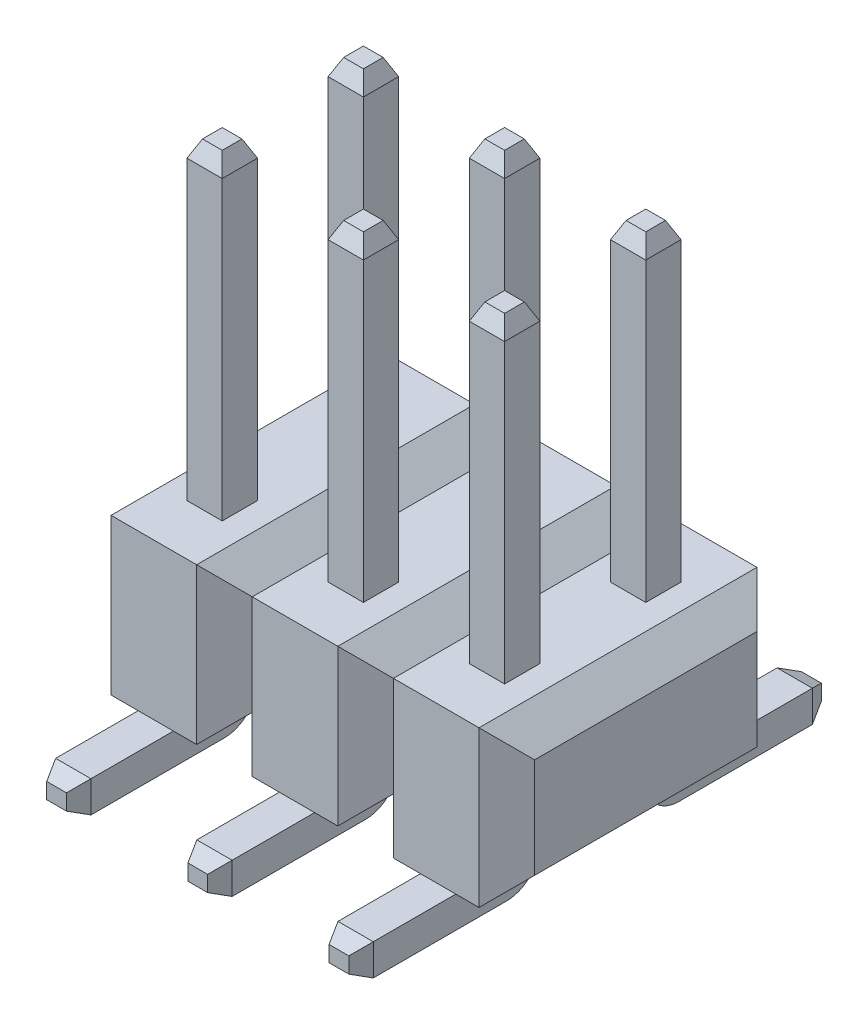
from build123d import *
from OCP.BRepFilletAPI import BRepFilletAPI_MakeChamfer

# Parameters (mm, degrees)
SKETCH1_W                = 2.54
SKETCH1_H                = 5
BOSS_EXTRUDE1_DEPTH      = 2.8
CHAMFER1_SIZE            = 0.5
LPATTERN1_COUNT          = 3
LPATTERN1_PITCH          = 2.54
BOSS_EXTRUDE2_DEPTH      = 5.635
BOSS_EXTRUDE2_DEPTH_BACK = 2.8
SKETCH2_W                = 0.635
SKETCH2_H                = 0.635
BOSS_EXTRUDE3_DEPTH      = 0.635
CHAMFER2_SIZE            = 0.3
CHAMFER2_SIZE2           = 0.139892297
LPATTERN3_COUNT          = 3
LPATTERN3_PITCH          = 2.54


with BuildPart() as part:
    # Sketch1 → Boss-Extrude1 (new body)
    with BuildSketch(Plane(origin=(0, 0, 0), x_dir=(1, 0, 0), z_dir=(0, 1, 0))):
        with Locations((1.27, 2.5)):
            Rectangle(SKETCH1_W, SKETCH1_H)
    extrude(amount=BOSS_EXTRUDE1_DEPTH)

    # Chamfer1
    chamfer1_edges = [part.edges().sort_by_distance(p)[0] for p in [
        (2.54, 2.8, -2.5),
        (0, 2.8, -2.5),
        (2.54, 0, -2.5),
        (0, 0, -2.5),
        (0, 1.4, -5),
        (2.54, 1.4, -5),
        (2.54, 1.4, 0),
        (0, 1.4, 0),
    ]]
    chamfer(chamfer1_edges, length=CHAMFER1_SIZE)


with BuildPart() as lpattern1_1:
    # LPattern1: pattern copy
    add(part.part.moved(Location(Vector(1, 0, 0) * (1 * LPATTERN1_PITCH))))


with BuildPart() as lpattern1_2:
    # LPattern1: pattern copy
    add(part.part.moved(Location(Vector(1, 0, 0) * (2 * LPATTERN1_PITCH))))


with BuildPart() as body_4:
    # Sketch2 → Boss-Extrude2 (new, two sides: drawn at the far end of the back side and taken through both)
    with BuildSketch(Plane(origin=(0, 2.8, 0), x_dir=(1, 0, 0), z_dir=(0, 1, 0)).offset(-BOSS_EXTRUDE2_DEPTH_BACK)):
        with Locations((1.27, 3.77)):
            Rectangle(SKETCH2_W, SKETCH2_H)
    extrude(amount=BOSS_EXTRUDE2_DEPTH + BOSS_EXTRUDE2_DEPTH_BACK)


with BuildPart() as body_5:
    # Sketch3 → Boss-Extrude3 (new body)
    with BuildSketch(Plane.ZY.offset(-0.9525)):
        with BuildLine():
            Line((-3.4525, 0), (-4.0875, 0))
            ThreePointArc((-4.0875, 0), (-4.097751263, -0.024748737), (-4.1225, -0.035))
            Line((-4.1225, -0.035), (-6.75, -0.035))
            Line((-6.75, -0.035), (-6.75, -0.6))
            Line((-6.75, -0.6), (-4.0525, -0.6))
            ThreePointArc((-4.0525, -0.6), (-3.628235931, -0.424264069), (-3.4525, 0))
        make_face()
    extrude(amount=-BOSS_EXTRUDE3_DEPTH)


with BuildPart() as body_4_1:
    add(body_4.part)

    # Combine1: union body 5
    add(body_5.part)

    # Chamfer2: one chamfer whose edges measure the first distance from different faces: ONE call of the kernel's chamfer builder (chamfer() names one face for all edges)
    chamfer2_edges_1 = [body_4_1.edges().sort_by_distance(p)[0] for p in [
        (0.9525, 8.435, -3.77),
        (0.9525, -0.3175, -6.75),
    ]]
    chamfer2_side_1 = [body_4_1.faces().sort_by_distance(p)[0] for p in [
        (0.9525, 8.33882062, -3.77),
    ]]
    chamfer2_edges_2 = [body_4_1.edges().sort_by_distance(p)[0] for p in [
        (1.27, 8.435, -3.4525),
    ]]
    chamfer2_side_2 = [body_4_1.faces().sort_by_distance(p)[0] for p in [
        (1.27, 4.2175, -3.4525),
    ]]
    chamfer2_edges_3 = [body_4_1.edges().sort_by_distance(p)[0] for p in [
        (1.5875, 8.435, -3.77),
        (1.5875, -0.3175, -6.75),
    ]]
    chamfer2_side_3 = [body_4_1.faces().sort_by_distance(p)[0] for p in [
        (1.5875, 4.2175, -3.99132062),
    ]]
    chamfer2_edges_4 = [body_4_1.edges().sort_by_distance(p)[0] for p in [
        (1.27, 8.435, -4.0875),
    ]]
    chamfer2_side_4 = [body_4_1.faces().sort_by_distance(p)[0] for p in [
        (1.27, 4.2175, -4.0875),
    ]]
    chamfer2_edges_5 = [body_4_1.edges().sort_by_distance(p)[0] for p in [
        (1.27, -0.6, -6.75),
    ]]
    chamfer2_side_5 = [body_4_1.faces().sort_by_distance(p)[0] for p in [
        (1.27, -0.6, -5.40125),
    ]]
    chamfer2_edges_6 = [body_4_1.edges().sort_by_distance(p)[0] for p in [
        (1.27, -0.035, -6.75),
    ]]
    chamfer2_side_6 = [body_4_1.faces().sort_by_distance(p)[0] for p in [
        (1.27, -0.035, -5.43625),
    ]]
    chamfer2 = BRepFilletAPI_MakeChamfer(body_4_1.part.solid().wrapped)
    for e in chamfer2_edges_1:
        chamfer2.Add(CHAMFER2_SIZE, CHAMFER2_SIZE2, e.wrapped, chamfer2_side_1[0].wrapped)  # the first distance lies on this face
    for e in chamfer2_edges_2:
        chamfer2.Add(CHAMFER2_SIZE, CHAMFER2_SIZE2, e.wrapped, chamfer2_side_2[0].wrapped)  # the first distance lies on this face
    for e in chamfer2_edges_3:
        chamfer2.Add(CHAMFER2_SIZE, CHAMFER2_SIZE2, e.wrapped, chamfer2_side_3[0].wrapped)  # the first distance lies on this face
    for e in chamfer2_edges_4:
        chamfer2.Add(CHAMFER2_SIZE, CHAMFER2_SIZE2, e.wrapped, chamfer2_side_4[0].wrapped)  # the first distance lies on this face
    for e in chamfer2_edges_5:
        chamfer2.Add(CHAMFER2_SIZE, CHAMFER2_SIZE2, e.wrapped, chamfer2_side_5[0].wrapped)  # the first distance lies on this face
    for e in chamfer2_edges_6:
        chamfer2.Add(CHAMFER2_SIZE, CHAMFER2_SIZE2, e.wrapped, chamfer2_side_6[0].wrapped)  # the first distance lies on this face
    add(Compound.cast(chamfer2.Shape()), mode=Mode.REPLACE)


with BuildPart() as body_5_2:
    # Mirror1: mirrored copy
    add(body_4_1.part.mirror(Plane(origin=(0, 0, -2.5), x_dir=(1, 0, 0), z_dir=(0, 0, -1))))


with BuildPart() as lpattern3_1:
    # LPattern3: pattern copy
    add(body_5_2.part.moved(Location(Vector(1, 0, 0) * (1 * LPATTERN3_PITCH))))


with BuildPart() as lpattern3_2:
    # LPattern3: pattern copy
    add(body_5_2.part.moved(Location(Vector(1, 0, 0) * (2 * LPATTERN3_PITCH))))


with BuildPart() as lpattern3_3:
    # LPattern3: pattern copy
    add(body_4_1.part.moved(Location(Vector(1, 0, 0) * (1 * LPATTERN3_PITCH))))


with BuildPart() as lpattern3_4:
    # LPattern3: pattern copy
    add(body_4_1.part.moved(Location(Vector(1, 0, 0) * (2 * LPATTERN3_PITCH))))


solid = Compound([part.part, lpattern1_1.part, lpattern1_2.part, body_4_1.part, body_5_2.part, lpattern3_1.part, lpattern3_2.part, lpattern3_3.part, lpattern3_4.part])
